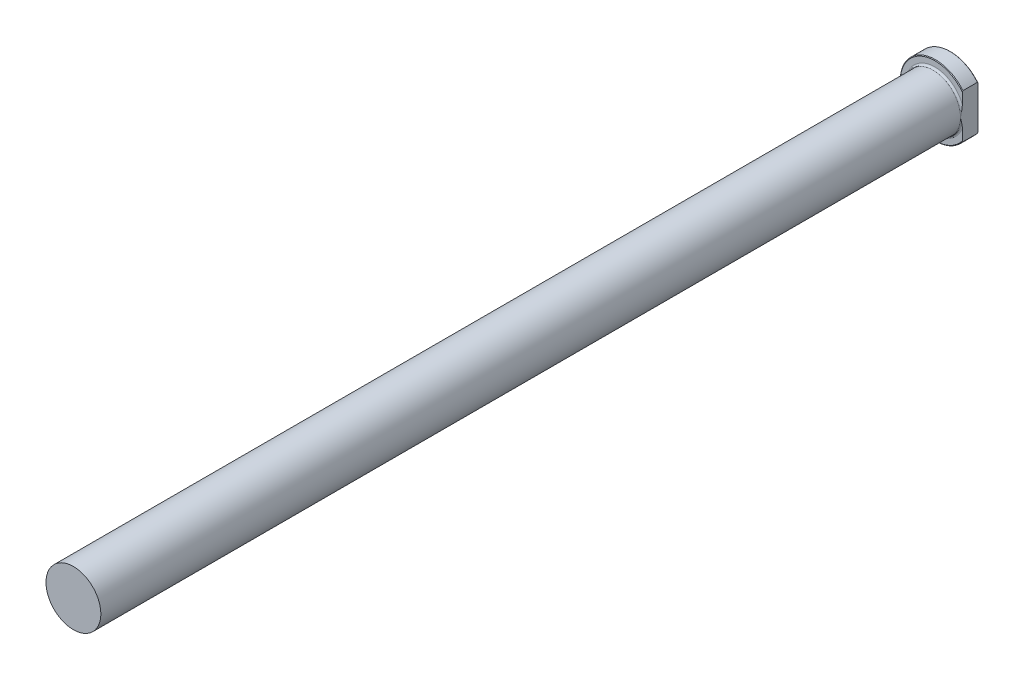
from build123d import *

# Parameters (mm, degrees)
CUT_EXTRUDE2_START = 7.62
CUT_EXTRUDE2_DEPTH = 7.62
CHAMFER1_SIZE      = 0.254


with BuildPart() as part:
    # Sketch2 → Revolve1 (revolve)
    with BuildSketch(Plane(origin=(0, 0, 0), x_dir=(0, 0, 1), z_dir=(1, 0, 0)), mode=Mode.PRIVATE) as revolve1_sk:
        with BuildLine():
            Line((355.6, 0), (0, 0))
            Line((0, 0), (0, 14.2875))
            Line((0, 14.2875), (6.35, 14.2875))
            Line((6.35, 14.2875), (6.35, 11.8745))
            ThreePointArc((6.35, 11.8745), (6.573184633, 11.335684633), (7.112, 11.1125))
            Line((7.112, 11.1125), (355.6, 11.1125))
            Line((355.6, 11.1125), (355.6, 0))
        make_face()
    revolve(revolve1_sk.sketch.rotate(Axis((0, 0, -2.147539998), (0, 0, 1)), 270), axis=Axis((0, 0, -2.147539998), (0, 0, 1)))

    # Sketch4 → Cut-Extrude2 (cut)
    with BuildSketch(Plane.XY.offset(CUT_EXTRUDE2_START)):
        with BuildLine():
            Line((11.1125, 8.980256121), (11.1125, -8.980256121))
            ThreePointArc((11.1125, -8.980256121), (14.2875, 0), (11.1125, 8.980256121))
        make_face()
    extrude(amount=-CUT_EXTRUDE2_DEPTH, mode=Mode.SUBTRACT)

    # Chamfer1
    chamfer1_edges = [part.edges().sort_by_distance(p)[0] for p in [
        (-14.2875, 0, 6.35),
        (-14.2875, 0, 0),
    ]]
    chamfer(chamfer1_edges, length=CHAMFER1_SIZE)


solid = part.part
